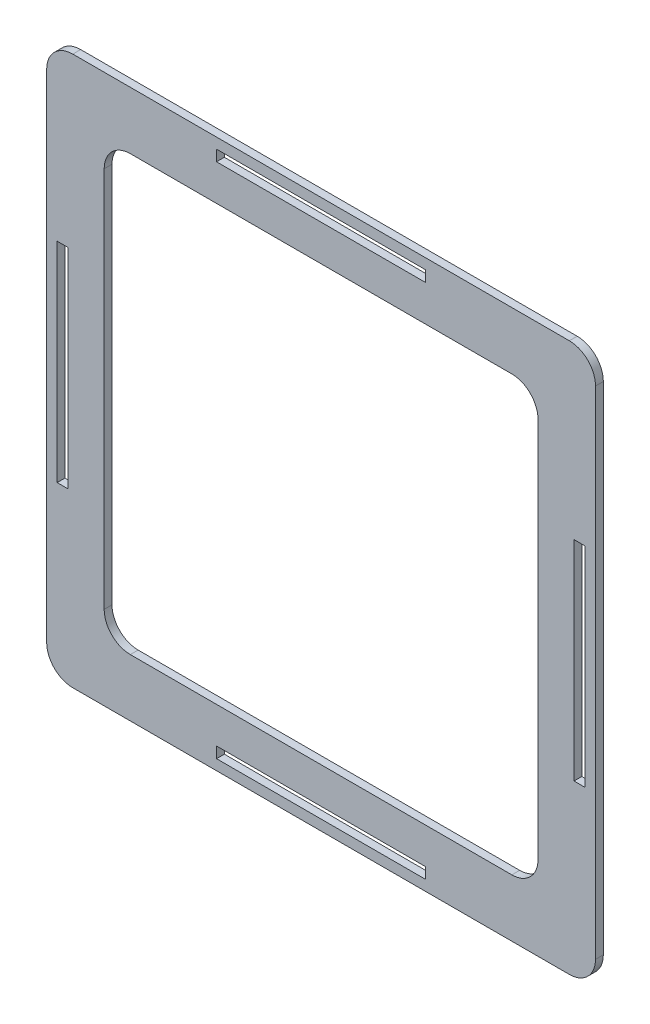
ISO-10303-21;
HEADER;
FILE_DESCRIPTION(('STEP AP214'),'2;1');
FILE_NAME('part.step','',(''),(''),'','','');
FILE_SCHEMA(('AUTOMOTIVE_DESIGN { 1 0 10303 214 1 1 1 1 }'));
ENDSEC;
DATA;
#1=APPLICATION_CONTEXT('core data for automotive mechanical design processes');
#2=APPLICATION_PROTOCOL_DEFINITION('international standard','automotive_design',2000,#1);
#3=PRODUCT_CONTEXT('',#1,'mechanical');
#4=PRODUCT('Part','Part','',(#3));
#5=PRODUCT_RELATED_PRODUCT_CATEGORY('part','',(#4));
#6=PRODUCT_DEFINITION_FORMATION('','',#4);
#7=PRODUCT_DEFINITION_CONTEXT('part definition',#1,'design');
#8=PRODUCT_DEFINITION('design','',#6,#7);
#9=PRODUCT_DEFINITION_SHAPE('','',#8);
#10=(LENGTH_UNIT() NAMED_UNIT(*) SI_UNIT(.MILLI.,.METRE.));
#11=(NAMED_UNIT(*) PLANE_ANGLE_UNIT() SI_UNIT($,.RADIAN.));
#12=(NAMED_UNIT(*) SI_UNIT($,.STERADIAN.) SOLID_ANGLE_UNIT());
#13=UNCERTAINTY_MEASURE_WITH_UNIT(LENGTH_MEASURE(1.E-05),#10,'distance_accuracy_value','');
#14=(GEOMETRIC_REPRESENTATION_CONTEXT(3) GLOBAL_UNCERTAINTY_ASSIGNED_CONTEXT((#13)) GLOBAL_UNIT_ASSIGNED_CONTEXT((#10,
#11,#12)) REPRESENTATION_CONTEXT('',''));
#15=CARTESIAN_POINT('',(0.,0.,0.));
#16=DIRECTION('',(0.,0.,1.));
#17=DIRECTION('',(1.,0.,0.));
#18=AXIS2_PLACEMENT_3D('',#15,#16,#17);
#19=CARTESIAN_POINT('',(47.5,-47.5,1.5));
#20=DIRECTION('',(0.,0.,1.));
#21=DIRECTION('',(1.,0.,0.));
#22=AXIS2_PLACEMENT_3D('',#19,#20,#21);
#23=PLANE('',#22);
#24=CARTESIAN_POINT('',(47.5,-47.5,1.5));
#25=DIRECTION('',(0.,0.,1.));
#26=DIRECTION('',(1.,0.,0.));
#27=AXIS2_PLACEMENT_3D('',#24,#25,#26);
#28=CIRCLE('',#27,5.);
#29=CARTESIAN_POINT('',(47.5,-52.5,1.5));
#30=VERTEX_POINT('',#29);
#31=CARTESIAN_POINT('',(52.5,-47.5,1.5));
#32=VERTEX_POINT('',#31);
#33=EDGE_CURVE('E510',#30,#32,#28,.T.);
#34=ORIENTED_EDGE('',*,*,#33,.T.);
#35=DIRECTION('',(0.,1.,0.));
#36=VECTOR('',#35,1.);
#37=CARTESIAN_POINT('',(52.5,47.4999999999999,1.5));
#38=LINE('',#37,#36);
#39=CARTESIAN_POINT('',(52.5,47.4999999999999,1.5));
#40=VERTEX_POINT('',#39);
#41=EDGE_CURVE('E514',#32,#40,#38,.T.);
#42=ORIENTED_EDGE('',*,*,#41,.T.);
#43=CARTESIAN_POINT('',(47.5,47.5,1.5));
#44=DIRECTION('',(0.,0.,1.));
#45=DIRECTION('',(-1.,0.,0.));
#46=AXIS2_PLACEMENT_3D('',#43,#44,#45);
#47=CIRCLE('',#46,5.);
#48=CARTESIAN_POINT('',(47.5,52.5,1.5));
#49=VERTEX_POINT('',#48);
#50=EDGE_CURVE('E518',#40,#49,#47,.T.);
#51=ORIENTED_EDGE('',*,*,#50,.T.);
#52=DIRECTION('',(-1.,0.,0.));
#53=VECTOR('',#52,1.);
#54=CARTESIAN_POINT('',(-47.4999999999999,52.5,1.5));
#55=LINE('',#54,#53);
#56=CARTESIAN_POINT('',(-47.4999999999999,52.5,1.5));
#57=VERTEX_POINT('',#56);
#58=EDGE_CURVE('E521',#49,#57,#55,.T.);
#59=ORIENTED_EDGE('',*,*,#58,.T.);
#60=CARTESIAN_POINT('',(-47.4999999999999,47.5,1.5));
#61=DIRECTION('',(0.,0.,1.));
#62=DIRECTION('',(1.,0.,0.));
#63=AXIS2_PLACEMENT_3D('',#60,#61,#62);
#64=CIRCLE('',#63,5.);
#65=CARTESIAN_POINT('',(-52.4999999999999,47.4999999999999,1.5));
#66=VERTEX_POINT('',#65);
#67=EDGE_CURVE('E524',#57,#66,#64,.T.);
#68=ORIENTED_EDGE('',*,*,#67,.T.);
#69=DIRECTION('',(0.,-1.,0.));
#70=VECTOR('',#69,1.);
#71=CARTESIAN_POINT('',(-52.4999999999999,47.4999999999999,1.5));
#72=LINE('',#71,#70);
#73=CARTESIAN_POINT('',(-52.4999999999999,-47.5,1.5));
#74=VERTEX_POINT('',#73);
#75=EDGE_CURVE('E527',#66,#74,#72,.T.);
#76=ORIENTED_EDGE('',*,*,#75,.T.);
#77=CARTESIAN_POINT('',(-47.4999999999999,-47.5,1.5));
#78=DIRECTION('',(0.,0.,1.));
#79=DIRECTION('',(1.,0.,0.));
#80=AXIS2_PLACEMENT_3D('',#77,#78,#79);
#81=CIRCLE('',#80,5.);
#82=CARTESIAN_POINT('',(-47.4999999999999,-52.5,1.5));
#83=VERTEX_POINT('',#82);
#84=EDGE_CURVE('E530',#74,#83,#81,.T.);
#85=ORIENTED_EDGE('',*,*,#84,.T.);
#86=DIRECTION('',(1.,0.,0.));
#87=VECTOR('',#86,1.);
#88=CARTESIAN_POINT('',(-47.4999999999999,-52.5,1.5));
#89=LINE('',#88,#87);
#90=EDGE_CURVE('E533',#83,#30,#89,.T.);
#91=ORIENTED_EDGE('',*,*,#90,.T.);
#92=EDGE_LOOP('',(#34,#42,#51,#59,#68,#76,#85,#91));
#93=FACE_BOUND('',#92,.T.);
#94=DIRECTION('',(1.,0.,0.));
#95=VECTOR('',#94,1.);
#96=CARTESIAN_POINT('',(-50.4999999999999,-20.,1.5));
#97=LINE('',#96,#95);
#98=CARTESIAN_POINT('',(-50.4999999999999,-20.,1.5));
#99=VERTEX_POINT('',#98);
#100=CARTESIAN_POINT('',(-48.3999999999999,-20.,1.5));
#101=VERTEX_POINT('',#100);
#102=EDGE_CURVE('E470',#99,#101,#97,.T.);
#103=ORIENTED_EDGE('',*,*,#102,.F.);
#104=DIRECTION('',(0.,-1.,0.));
#105=VECTOR('',#104,1.);
#106=CARTESIAN_POINT('',(-50.4999999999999,20.,1.5));
#107=LINE('',#106,#105);
#108=CARTESIAN_POINT('',(-50.4999999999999,20.,1.5));
#109=VERTEX_POINT('',#108);
#110=EDGE_CURVE('E467',#109,#99,#107,.T.);
#111=ORIENTED_EDGE('',*,*,#110,.F.);
#112=DIRECTION('',(-1.,0.,0.));
#113=VECTOR('',#112,1.);
#114=CARTESIAN_POINT('',(-50.4999999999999,20.,1.5));
#115=LINE('',#114,#113);
#116=CARTESIAN_POINT('',(-48.3999999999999,20.,1.5));
#117=VERTEX_POINT('',#116);
#118=EDGE_CURVE('E478',#117,#109,#115,.T.);
#119=ORIENTED_EDGE('',*,*,#118,.F.);
#120=DIRECTION('',(0.,1.,0.));
#121=VECTOR('',#120,1.);
#122=CARTESIAN_POINT('',(-48.3999999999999,20.,1.5));
#123=LINE('',#122,#121);
#124=EDGE_CURVE('E474',#101,#117,#123,.T.);
#125=ORIENTED_EDGE('',*,*,#124,.F.);
#126=EDGE_LOOP('',(#103,#111,#119,#125));
#127=FACE_BOUND('',#126,.T.);
#128=DIRECTION('',(0.,-1.,0.));
#129=VECTOR('',#128,1.);
#130=CARTESIAN_POINT('',(-20.0000000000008,50.5000000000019,1.5));
#131=LINE('',#130,#129);
#132=CARTESIAN_POINT('',(-20.0000000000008,50.5000000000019,1.5));
#133=VERTEX_POINT('',#132);
#134=CARTESIAN_POINT('',(-20.0000000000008,48.4000000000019,1.5));
#135=VERTEX_POINT('',#134);
#136=EDGE_CURVE('E427',#133,#135,#131,.T.);
#137=ORIENTED_EDGE('',*,*,#136,.F.);
#138=DIRECTION('',(-1.,0.,0.));
#139=VECTOR('',#138,1.);
#140=CARTESIAN_POINT('',(19.9999999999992,50.5000000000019,1.5));
#141=LINE('',#140,#139);
#142=CARTESIAN_POINT('',(19.9999999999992,50.5000000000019,1.5));
#143=VERTEX_POINT('',#142);
#144=EDGE_CURVE('E424',#143,#133,#141,.T.);
#145=ORIENTED_EDGE('',*,*,#144,.F.);
#146=DIRECTION('',(0.,1.,0.));
#147=VECTOR('',#146,1.);
#148=CARTESIAN_POINT('',(19.9999999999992,50.5000000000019,1.5));
#149=LINE('',#148,#147);
#150=CARTESIAN_POINT('',(19.9999999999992,48.4000000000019,1.5));
#151=VERTEX_POINT('',#150);
#152=EDGE_CURVE('E435',#151,#143,#149,.T.);
#153=ORIENTED_EDGE('',*,*,#152,.F.);
#154=DIRECTION('',(1.,0.,0.));
#155=VECTOR('',#154,1.);
#156=CARTESIAN_POINT('',(19.9999999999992,48.4000000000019,1.5));
#157=LINE('',#156,#155);
#158=EDGE_CURVE('E431',#135,#151,#157,.T.);
#159=ORIENTED_EDGE('',*,*,#158,.F.);
#160=EDGE_LOOP('',(#137,#145,#153,#159));
#161=FACE_BOUND('',#160,.T.);
#162=DIRECTION('',(-1.,0.,0.));
#163=VECTOR('',#162,1.);
#164=CARTESIAN_POINT('',(50.5000000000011,20.0000000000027,1.5));
#165=LINE('',#164,#163);
#166=CARTESIAN_POINT('',(50.5000000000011,20.0000000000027,1.5));
#167=VERTEX_POINT('',#166);
#168=CARTESIAN_POINT('',(48.4000000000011,20.0000000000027,1.5));
#169=VERTEX_POINT('',#168);
#170=EDGE_CURVE('E384',#167,#169,#165,.T.);
#171=ORIENTED_EDGE('',*,*,#170,.F.);
#172=DIRECTION('',(0.,1.,0.));
#173=VECTOR('',#172,1.);
#174=CARTESIAN_POINT('',(50.5000000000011,-19.9999999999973,1.5));
#175=LINE('',#174,#173);
#176=CARTESIAN_POINT('',(50.5000000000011,-19.9999999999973,1.5));
#177=VERTEX_POINT('',#176);
#178=EDGE_CURVE('E381',#177,#167,#175,.T.);
#179=ORIENTED_EDGE('',*,*,#178,.F.);
#180=DIRECTION('',(1.,0.,0.));
#181=VECTOR('',#180,1.);
#182=CARTESIAN_POINT('',(50.5000000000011,-19.9999999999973,1.5));
#183=LINE('',#182,#181);
#184=CARTESIAN_POINT('',(48.4000000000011,-19.9999999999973,1.5));
#185=VERTEX_POINT('',#184);
#186=EDGE_CURVE('E392',#185,#177,#183,.T.);
#187=ORIENTED_EDGE('',*,*,#186,.F.);
#188=DIRECTION('',(0.,-1.,0.));
#189=VECTOR('',#188,1.);
#190=CARTESIAN_POINT('',(48.4000000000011,-19.9999999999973,1.5));
#191=LINE('',#190,#189);
#192=EDGE_CURVE('E388',#169,#185,#191,.T.);
#193=ORIENTED_EDGE('',*,*,#192,.F.);
#194=EDGE_LOOP('',(#171,#179,#187,#193));
#195=FACE_BOUND('',#194,.T.);
#196=DIRECTION('',(0.,1.,0.));
#197=VECTOR('',#196,1.);
#198=CARTESIAN_POINT('',(20.000000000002,-50.4999999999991,1.5));
#199=LINE('',#198,#197);
#200=CARTESIAN_POINT('',(20.000000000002,-50.4999999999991,1.5));
#201=VERTEX_POINT('',#200);
#202=CARTESIAN_POINT('',(20.000000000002,-48.3999999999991,1.5));
#203=VERTEX_POINT('',#202);
#204=EDGE_CURVE('E341',#201,#203,#199,.T.);
#205=ORIENTED_EDGE('',*,*,#204,.F.);
#206=DIRECTION('',(1.,0.,0.));
#207=VECTOR('',#206,1.);
#208=CARTESIAN_POINT('',(-19.999999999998,-50.4999999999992,1.5));
#209=LINE('',#208,#207);
#210=CARTESIAN_POINT('',(-19.999999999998,-50.4999999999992,1.5));
#211=VERTEX_POINT('',#210);
#212=EDGE_CURVE('E338',#211,#201,#209,.T.);
#213=ORIENTED_EDGE('',*,*,#212,.F.);
#214=DIRECTION('',(0.,-1.,0.));
#215=VECTOR('',#214,1.);
#216=CARTESIAN_POINT('',(-19.999999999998,-50.4999999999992,1.5));
#217=LINE('',#216,#215);
#218=CARTESIAN_POINT('',(-19.999999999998,-48.3999999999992,1.5));
#219=VERTEX_POINT('',#218);
#220=EDGE_CURVE('E349',#219,#211,#217,.T.);
#221=ORIENTED_EDGE('',*,*,#220,.F.);
#222=DIRECTION('',(-1.,0.,0.));
#223=VECTOR('',#222,1.);
#224=CARTESIAN_POINT('',(-19.999999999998,-48.3999999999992,1.5));
#225=LINE('',#224,#223);
#226=EDGE_CURVE('E345',#203,#219,#225,.T.);
#227=ORIENTED_EDGE('',*,*,#226,.F.);
#228=EDGE_LOOP('',(#205,#213,#221,#227));
#229=FACE_BOUND('',#228,.T.);
#230=DIRECTION('',(1.,0.,0.));
#231=VECTOR('',#230,1.);
#232=CARTESIAN_POINT('',(-36.5,-41.5,1.5));
#233=LINE('',#232,#231);
#234=CARTESIAN_POINT('',(-36.5,-41.5,1.5));
#235=VERTEX_POINT('',#234);
#236=CARTESIAN_POINT('',(36.5,-41.5,1.5));
#237=VERTEX_POINT('',#236);
#238=EDGE_CURVE('E258',#235,#237,#233,.T.);
#239=ORIENTED_EDGE('',*,*,#238,.F.);
#240=CARTESIAN_POINT('',(-36.5,-36.5,1.5));
#241=DIRECTION('',(0.,0.,1.));
#242=DIRECTION('',(1.,0.,0.));
#243=AXIS2_PLACEMENT_3D('',#240,#241,#242);
#244=CIRCLE('',#243,4.99999999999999);
#245=CARTESIAN_POINT('',(-41.5,-36.5,1.5));
#246=VERTEX_POINT('',#245);
#247=EDGE_CURVE('E249',#246,#235,#244,.T.);
#248=ORIENTED_EDGE('',*,*,#247,.F.);
#249=DIRECTION('',(0.,-1.,0.));
#250=VECTOR('',#249,1.);
#251=CARTESIAN_POINT('',(-41.5,36.5,1.5));
#252=LINE('',#251,#250);
#253=CARTESIAN_POINT('',(-41.5,36.5,1.5));
#254=VERTEX_POINT('',#253);
#255=EDGE_CURVE('E290',#254,#246,#252,.T.);
#256=ORIENTED_EDGE('',*,*,#255,.F.);
#257=CARTESIAN_POINT('',(-36.5,36.5,1.5));
#258=DIRECTION('',(0.,0.,1.));
#259=DIRECTION('',(-1.,0.,0.));
#260=AXIS2_PLACEMENT_3D('',#257,#258,#259);
#261=CIRCLE('',#260,4.99999999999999);
#262=CARTESIAN_POINT('',(-36.5,41.5,1.5));
#263=VERTEX_POINT('',#262);
#264=EDGE_CURVE('E287',#263,#254,#261,.T.);
#265=ORIENTED_EDGE('',*,*,#264,.F.);
#266=DIRECTION('',(-1.,0.,0.));
#267=VECTOR('',#266,1.);
#268=CARTESIAN_POINT('',(-36.5,41.4999999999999,1.5));
#269=LINE('',#268,#267);
#270=CARTESIAN_POINT('',(36.5,41.5,1.5));
#271=VERTEX_POINT('',#270);
#272=EDGE_CURVE('E284',#271,#263,#269,.T.);
#273=ORIENTED_EDGE('',*,*,#272,.F.);
#274=CARTESIAN_POINT('',(36.5,36.5,1.5));
#275=DIRECTION('',(0.,0.,1.));
#276=DIRECTION('',(-1.,0.,0.));
#277=AXIS2_PLACEMENT_3D('',#274,#275,#276);
#278=CIRCLE('',#277,4.99999999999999);
#279=CARTESIAN_POINT('',(41.5,36.5,1.5));
#280=VERTEX_POINT('',#279);
#281=EDGE_CURVE('E281',#280,#271,#278,.T.);
#282=ORIENTED_EDGE('',*,*,#281,.F.);
#283=DIRECTION('',(0.,1.,0.));
#284=VECTOR('',#283,1.);
#285=CARTESIAN_POINT('',(41.5,36.5,1.5));
#286=LINE('',#285,#284);
#287=CARTESIAN_POINT('',(41.5,-36.5,1.5));
#288=VERTEX_POINT('',#287);
#289=EDGE_CURVE('E276',#288,#280,#286,.T.);
#290=ORIENTED_EDGE('',*,*,#289,.F.);
#291=CARTESIAN_POINT('',(36.5,-36.5,1.5));
#292=DIRECTION('',(0.,0.,1.));
#293=DIRECTION('',(1.,0.,0.));
#294=AXIS2_PLACEMENT_3D('',#291,#292,#293);
#295=CIRCLE('',#294,5.);
#296=EDGE_CURVE('E272',#237,#288,#295,.T.);
#297=ORIENTED_EDGE('',*,*,#296,.F.);
#298=EDGE_LOOP('',(#239,#248,#256,#265,#273,#282,#290,#297));
#299=FACE_BOUND('',#298,.T.);
#300=ADVANCED_FACE('F39',(#93,#127,#161,#195,#229,#299),#23,.T.);
#301=CARTESIAN_POINT('',(47.5,-47.5,0.));
#302=DIRECTION('',(0.,0.,1.));
#303=DIRECTION('',(1.,0.,0.));
#304=AXIS2_PLACEMENT_3D('',#301,#302,#303);
#305=PLANE('',#304);
#306=DIRECTION('',(1.,0.,0.));
#307=VECTOR('',#306,1.);
#308=CARTESIAN_POINT('',(-19.999999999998,-50.4999999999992,0.));
#309=LINE('',#308,#307);
#310=CARTESIAN_POINT('',(-19.999999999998,-50.4999999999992,0.));
#311=VERTEX_POINT('',#310);
#312=CARTESIAN_POINT('',(20.000000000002,-50.4999999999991,0.));
#313=VERTEX_POINT('',#312);
#314=EDGE_CURVE('E267',#311,#313,#309,.T.);
#315=ORIENTED_EDGE('',*,*,#314,.T.);
#316=DIRECTION('',(0.,1.,0.));
#317=VECTOR('',#316,1.);
#318=CARTESIAN_POINT('',(20.000000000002,-50.4999999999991,0.));
#319=LINE('',#318,#317);
#320=CARTESIAN_POINT('',(20.000000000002,-48.3999999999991,0.));
#321=VERTEX_POINT('',#320);
#322=EDGE_CURVE('E356',#313,#321,#319,.T.);
#323=ORIENTED_EDGE('',*,*,#322,.T.);
#324=DIRECTION('',(-1.,0.,0.));
#325=VECTOR('',#324,1.);
#326=CARTESIAN_POINT('',(-19.999999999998,-48.3999999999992,0.));
#327=LINE('',#326,#325);
#328=CARTESIAN_POINT('',(-19.999999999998,-48.3999999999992,0.));
#329=VERTEX_POINT('',#328);
#330=EDGE_CURVE('E360',#321,#329,#327,.T.);
#331=ORIENTED_EDGE('',*,*,#330,.T.);
#332=DIRECTION('',(0.,-1.,0.));
#333=VECTOR('',#332,1.);
#334=CARTESIAN_POINT('',(-19.999999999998,-50.4999999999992,0.));
#335=LINE('',#334,#333);
#336=EDGE_CURVE('E342',#329,#311,#335,.T.);
#337=ORIENTED_EDGE('',*,*,#336,.T.);
#338=EDGE_LOOP('',(#315,#323,#331,#337));
#339=FACE_BOUND('',#338,.T.);
#340=DIRECTION('',(-1.,0.,0.));
#341=VECTOR('',#340,1.);
#342=CARTESIAN_POINT('',(19.9999999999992,50.5000000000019,0.));
#343=LINE('',#342,#341);
#344=CARTESIAN_POINT('',(19.9999999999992,50.5000000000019,0.));
#345=VERTEX_POINT('',#344);
#346=CARTESIAN_POINT('',(-20.0000000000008,50.5000000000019,0.));
#347=VERTEX_POINT('',#346);
#348=EDGE_CURVE('E423',#345,#347,#343,.T.);
#349=ORIENTED_EDGE('',*,*,#348,.T.);
#350=DIRECTION('',(0.,-1.,0.));
#351=VECTOR('',#350,1.);
#352=CARTESIAN_POINT('',(-20.0000000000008,50.5000000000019,0.));
#353=LINE('',#352,#351);
#354=CARTESIAN_POINT('',(-20.0000000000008,48.4000000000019,0.));
#355=VERTEX_POINT('',#354);
#356=EDGE_CURVE('E442',#347,#355,#353,.T.);
#357=ORIENTED_EDGE('',*,*,#356,.T.);
#358=DIRECTION('',(1.,0.,0.));
#359=VECTOR('',#358,1.);
#360=CARTESIAN_POINT('',(19.9999999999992,48.4000000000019,0.));
#361=LINE('',#360,#359);
#362=CARTESIAN_POINT('',(19.9999999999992,48.4000000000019,0.));
#363=VERTEX_POINT('',#362);
#364=EDGE_CURVE('E446',#355,#363,#361,.T.);
#365=ORIENTED_EDGE('',*,*,#364,.T.);
#366=DIRECTION('',(0.,1.,0.));
#367=VECTOR('',#366,1.);
#368=CARTESIAN_POINT('',(19.9999999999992,50.5000000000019,0.));
#369=LINE('',#368,#367);
#370=EDGE_CURVE('E428',#363,#345,#369,.T.);
#371=ORIENTED_EDGE('',*,*,#370,.T.);
#372=EDGE_LOOP('',(#349,#357,#365,#371));
#373=FACE_BOUND('',#372,.T.);
#374=CARTESIAN_POINT('',(47.5,-47.5,0.));
#375=DIRECTION('',(0.,0.,1.));
#376=DIRECTION('',(1.,0.,0.));
#377=AXIS2_PLACEMENT_3D('',#374,#375,#376);
#378=CIRCLE('',#377,5.);
#379=CARTESIAN_POINT('',(47.5,-52.5,0.));
#380=VERTEX_POINT('',#379);
#381=CARTESIAN_POINT('',(52.5,-47.5,0.));
#382=VERTEX_POINT('',#381);
#383=EDGE_CURVE('E509',#380,#382,#378,.T.);
#384=ORIENTED_EDGE('',*,*,#383,.F.);
#385=DIRECTION('',(1.,0.,0.));
#386=VECTOR('',#385,1.);
#387=CARTESIAN_POINT('',(-47.4999999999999,-52.5,0.));
#388=LINE('',#387,#386);
#389=CARTESIAN_POINT('',(-47.4999999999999,-52.5,0.));
#390=VERTEX_POINT('',#389);
#391=EDGE_CURVE('E515',#390,#380,#388,.T.);
#392=ORIENTED_EDGE('',*,*,#391,.F.);
#393=CARTESIAN_POINT('',(-47.4999999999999,-47.5,0.));
#394=DIRECTION('',(0.,0.,1.));
#395=DIRECTION('',(1.,0.,0.));
#396=AXIS2_PLACEMENT_3D('',#393,#394,#395);
#397=CIRCLE('',#396,5.);
#398=CARTESIAN_POINT('',(-52.4999999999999,-47.5,0.));
#399=VERTEX_POINT('',#398);
#400=EDGE_CURVE('E555',#399,#390,#397,.T.);
#401=ORIENTED_EDGE('',*,*,#400,.F.);
#402=DIRECTION('',(0.,-1.,0.));
#403=VECTOR('',#402,1.);
#404=CARTESIAN_POINT('',(-52.4999999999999,47.4999999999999,0.));
#405=LINE('',#404,#403);
#406=CARTESIAN_POINT('',(-52.4999999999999,47.4999999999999,0.));
#407=VERTEX_POINT('',#406);
#408=EDGE_CURVE('E552',#407,#399,#405,.T.);
#409=ORIENTED_EDGE('',*,*,#408,.F.);
#410=CARTESIAN_POINT('',(-47.4999999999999,47.5,0.));
#411=DIRECTION('',(0.,0.,1.));
#412=DIRECTION('',(1.,0.,0.));
#413=AXIS2_PLACEMENT_3D('',#410,#411,#412);
#414=CIRCLE('',#413,5.);
#415=CARTESIAN_POINT('',(-47.4999999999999,52.5,0.));
#416=VERTEX_POINT('',#415);
#417=EDGE_CURVE('E549',#416,#407,#414,.T.);
#418=ORIENTED_EDGE('',*,*,#417,.F.);
#419=DIRECTION('',(-1.,0.,0.));
#420=VECTOR('',#419,1.);
#421=CARTESIAN_POINT('',(-47.4999999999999,52.5,0.));
#422=LINE('',#421,#420);
#423=CARTESIAN_POINT('',(47.5,52.5,0.));
#424=VERTEX_POINT('',#423);
#425=EDGE_CURVE('E546',#424,#416,#422,.T.);
#426=ORIENTED_EDGE('',*,*,#425,.F.);
#427=CARTESIAN_POINT('',(47.5,47.5,0.));
#428=DIRECTION('',(0.,0.,1.));
#429=DIRECTION('',(-1.,0.,0.));
#430=AXIS2_PLACEMENT_3D('',#427,#428,#429);
#431=CIRCLE('',#430,5.);
#432=CARTESIAN_POINT('',(52.5,47.4999999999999,0.));
#433=VERTEX_POINT('',#432);
#434=EDGE_CURVE('E543',#433,#424,#431,.T.);
#435=ORIENTED_EDGE('',*,*,#434,.F.);
#436=DIRECTION('',(0.,1.,0.));
#437=VECTOR('',#436,1.);
#438=CARTESIAN_POINT('',(52.5,47.4999999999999,0.));
#439=LINE('',#438,#437);
#440=EDGE_CURVE('E540',#382,#433,#439,.T.);
#441=ORIENTED_EDGE('',*,*,#440,.F.);
#442=EDGE_LOOP('',(#384,#392,#401,#409,#418,#426,#435,#441));
#443=FACE_BOUND('',#442,.T.);
#444=DIRECTION('',(0.,-1.,0.));
#445=VECTOR('',#444,1.);
#446=CARTESIAN_POINT('',(-50.4999999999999,20.,0.));
#447=LINE('',#446,#445);
#448=CARTESIAN_POINT('',(-50.4999999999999,20.,0.));
#449=VERTEX_POINT('',#448);
#450=CARTESIAN_POINT('',(-50.4999999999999,-20.,0.));
#451=VERTEX_POINT('',#450);
#452=EDGE_CURVE('E466',#449,#451,#447,.T.);
#453=ORIENTED_EDGE('',*,*,#452,.T.);
#454=DIRECTION('',(1.,0.,0.));
#455=VECTOR('',#454,1.);
#456=CARTESIAN_POINT('',(-50.4999999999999,-20.,0.));
#457=LINE('',#456,#455);
#458=CARTESIAN_POINT('',(-48.3999999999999,-20.,0.));
#459=VERTEX_POINT('',#458);
#460=EDGE_CURVE('E485',#451,#459,#457,.T.);
#461=ORIENTED_EDGE('',*,*,#460,.T.);
#462=DIRECTION('',(0.,1.,0.));
#463=VECTOR('',#462,1.);
#464=CARTESIAN_POINT('',(-48.3999999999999,20.,0.));
#465=LINE('',#464,#463);
#466=CARTESIAN_POINT('',(-48.3999999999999,20.,0.));
#467=VERTEX_POINT('',#466);
#468=EDGE_CURVE('E489',#459,#467,#465,.T.);
#469=ORIENTED_EDGE('',*,*,#468,.T.);
#470=DIRECTION('',(-1.,0.,0.));
#471=VECTOR('',#470,1.);
#472=CARTESIAN_POINT('',(-50.4999999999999,20.,0.));
#473=LINE('',#472,#471);
#474=EDGE_CURVE('E471',#467,#449,#473,.T.);
#475=ORIENTED_EDGE('',*,*,#474,.T.);
#476=EDGE_LOOP('',(#453,#461,#469,#475));
#477=FACE_BOUND('',#476,.T.);
#478=DIRECTION('',(0.,1.,0.));
#479=VECTOR('',#478,1.);
#480=CARTESIAN_POINT('',(50.5000000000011,-19.9999999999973,0.));
#481=LINE('',#480,#479);
#482=CARTESIAN_POINT('',(50.5000000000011,-19.9999999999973,0.));
#483=VERTEX_POINT('',#482);
#484=CARTESIAN_POINT('',(50.5000000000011,20.0000000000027,0.));
#485=VERTEX_POINT('',#484);
#486=EDGE_CURVE('E380',#483,#485,#481,.T.);
#487=ORIENTED_EDGE('',*,*,#486,.T.);
#488=DIRECTION('',(-1.,0.,0.));
#489=VECTOR('',#488,1.);
#490=CARTESIAN_POINT('',(50.5000000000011,20.0000000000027,0.));
#491=LINE('',#490,#489);
#492=CARTESIAN_POINT('',(48.4000000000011,20.0000000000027,0.));
#493=VERTEX_POINT('',#492);
#494=EDGE_CURVE('E399',#485,#493,#491,.T.);
#495=ORIENTED_EDGE('',*,*,#494,.T.);
#496=DIRECTION('',(0.,-1.,0.));
#497=VECTOR('',#496,1.);
#498=CARTESIAN_POINT('',(48.4000000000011,-19.9999999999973,0.));
#499=LINE('',#498,#497);
#500=CARTESIAN_POINT('',(48.4000000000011,-19.9999999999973,0.));
#501=VERTEX_POINT('',#500);
#502=EDGE_CURVE('E403',#493,#501,#499,.T.);
#503=ORIENTED_EDGE('',*,*,#502,.T.);
#504=DIRECTION('',(1.,0.,0.));
#505=VECTOR('',#504,1.);
#506=CARTESIAN_POINT('',(50.5000000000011,-19.9999999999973,0.));
#507=LINE('',#506,#505);
#508=EDGE_CURVE('E385',#501,#483,#507,.T.);
#509=ORIENTED_EDGE('',*,*,#508,.T.);
#510=EDGE_LOOP('',(#487,#495,#503,#509));
#511=FACE_BOUND('',#510,.T.);
#512=CARTESIAN_POINT('',(-36.5,-36.5,0.));
#513=DIRECTION('',(0.,0.,1.));
#514=DIRECTION('',(1.,0.,0.));
#515=AXIS2_PLACEMENT_3D('',#512,#513,#514);
#516=CIRCLE('',#515,4.99999999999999);
#517=CARTESIAN_POINT('',(-41.5,-36.5,0.));
#518=VERTEX_POINT('',#517);
#519=CARTESIAN_POINT('',(-36.5,-41.5,0.));
#520=VERTEX_POINT('',#519);
#521=EDGE_CURVE('E63',#518,#520,#516,.T.);
#522=ORIENTED_EDGE('',*,*,#521,.T.);
#523=DIRECTION('',(1.,0.,0.));
#524=VECTOR('',#523,1.);
#525=CARTESIAN_POINT('',(-36.5,-41.5,0.));
#526=LINE('',#525,#524);
#527=CARTESIAN_POINT('',(36.5,-41.5,0.));
#528=VERTEX_POINT('',#527);
#529=EDGE_CURVE('E265',#520,#528,#526,.T.);
#530=ORIENTED_EDGE('',*,*,#529,.T.);
#531=CARTESIAN_POINT('',(36.5,-36.5,0.));
#532=DIRECTION('',(0.,0.,1.));
#533=DIRECTION('',(1.,0.,0.));
#534=AXIS2_PLACEMENT_3D('',#531,#532,#533);
#535=CIRCLE('',#534,5.);
#536=CARTESIAN_POINT('',(41.5,-36.5,0.));
#537=VERTEX_POINT('',#536);
#538=EDGE_CURVE('E297',#528,#537,#535,.T.);
#539=ORIENTED_EDGE('',*,*,#538,.T.);
#540=DIRECTION('',(0.,1.,0.));
#541=VECTOR('',#540,1.);
#542=CARTESIAN_POINT('',(41.5,36.5,0.));
#543=LINE('',#542,#541);
#544=CARTESIAN_POINT('',(41.5,36.5,0.));
#545=VERTEX_POINT('',#544);
#546=EDGE_CURVE('E301',#537,#545,#543,.T.);
#547=ORIENTED_EDGE('',*,*,#546,.T.);
#548=CARTESIAN_POINT('',(36.5,36.5,0.));
#549=DIRECTION('',(0.,0.,1.));
#550=DIRECTION('',(-1.,0.,0.));
#551=AXIS2_PLACEMENT_3D('',#548,#549,#550);
#552=CIRCLE('',#551,4.99999999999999);
#553=CARTESIAN_POINT('',(36.5,41.5,0.));
#554=VERTEX_POINT('',#553);
#555=EDGE_CURVE('E305',#545,#554,#552,.T.);
#556=ORIENTED_EDGE('',*,*,#555,.T.);
#557=DIRECTION('',(-1.,0.,0.));
#558=VECTOR('',#557,1.);
#559=CARTESIAN_POINT('',(-36.5,41.4999999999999,0.));
#560=LINE('',#559,#558);
#561=CARTESIAN_POINT('',(-36.5,41.5,0.));
#562=VERTEX_POINT('',#561);
#563=EDGE_CURVE('E309',#554,#562,#560,.T.);
#564=ORIENTED_EDGE('',*,*,#563,.T.);
#565=CARTESIAN_POINT('',(-36.5,36.5,0.));
#566=DIRECTION('',(0.,0.,1.));
#567=DIRECTION('',(-1.,0.,0.));
#568=AXIS2_PLACEMENT_3D('',#565,#566,#567);
#569=CIRCLE('',#568,4.99999999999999);
#570=CARTESIAN_POINT('',(-41.5,36.5,0.));
#571=VERTEX_POINT('',#570);
#572=EDGE_CURVE('E313',#562,#571,#569,.T.);
#573=ORIENTED_EDGE('',*,*,#572,.T.);
#574=DIRECTION('',(0.,-1.,0.));
#575=VECTOR('',#574,1.);
#576=CARTESIAN_POINT('',(-41.5,36.5,0.));
#577=LINE('',#576,#575);
#578=EDGE_CURVE('E259',#571,#518,#577,.T.);
#579=ORIENTED_EDGE('',*,*,#578,.T.);
#580=EDGE_LOOP('',(#522,#530,#539,#547,#556,#564,#573,#579));
#581=FACE_BOUND('',#580,.T.);
#582=ADVANCED_FACE('F594',(#339,#373,#443,#477,#511,#581),#305,.F.);
#583=CARTESIAN_POINT('',(47.5,-47.5,1.5));
#584=DIRECTION('',(0.,0.,-1.));
#585=DIRECTION('',(-1.,0.,0.));
#586=AXIS2_PLACEMENT_3D('',#583,#584,#585);
#587=CYLINDRICAL_SURFACE('',#586,5.);
#588=ORIENTED_EDGE('',*,*,#383,.T.);
#589=DIRECTION('',(0.,0.,-1.));
#590=VECTOR('',#589,1.);
#591=CARTESIAN_POINT('',(52.5,-47.5,1.5));
#592=LINE('',#591,#590);
#593=EDGE_CURVE('E11',#32,#382,#592,.T.);
#594=ORIENTED_EDGE('',*,*,#593,.F.);
#595=ORIENTED_EDGE('',*,*,#33,.F.);
#596=DIRECTION('',(0.,0.,-1.));
#597=VECTOR('',#596,1.);
#598=CARTESIAN_POINT('',(47.5,-52.5,1.5));
#599=LINE('',#598,#597);
#600=EDGE_CURVE('E536',#30,#380,#599,.T.);
#601=ORIENTED_EDGE('',*,*,#600,.T.);
#602=EDGE_LOOP('',(#588,#594,#595,#601));
#603=FACE_BOUND('',#602,.T.);
#604=ADVANCED_FACE('F41',(#603),#587,.T.);
#605=CARTESIAN_POINT('',(52.5,47.4999999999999,1.5));
#606=DIRECTION('',(-1.,0.,0.));
#607=DIRECTION('',(0.,-1.,0.));
#608=AXIS2_PLACEMENT_3D('',#605,#606,#607);
#609=PLANE('',#608);
#610=ORIENTED_EDGE('',*,*,#440,.T.);
#611=DIRECTION('',(0.,0.,-1.));
#612=VECTOR('',#611,1.);
#613=CARTESIAN_POINT('',(52.5,47.4999999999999,1.5));
#614=LINE('',#613,#612);
#615=EDGE_CURVE('E48',#40,#433,#614,.T.);
#616=ORIENTED_EDGE('',*,*,#615,.F.);
#617=ORIENTED_EDGE('',*,*,#41,.F.);
#618=ORIENTED_EDGE('',*,*,#593,.T.);
#619=EDGE_LOOP('',(#610,#616,#617,#618));
#620=FACE_BOUND('',#619,.T.);
#621=ADVANCED_FACE('F612',(#620),#609,.F.);
#622=CARTESIAN_POINT('',(47.5,47.5,1.5));
#623=DIRECTION('',(0.,0.,-1.));
#624=DIRECTION('',(-1.,0.,0.));
#625=AXIS2_PLACEMENT_3D('',#622,#623,#624);
#626=CYLINDRICAL_SURFACE('',#625,5.);
#627=ORIENTED_EDGE('',*,*,#434,.T.);
#628=DIRECTION('',(0.,0.,-1.));
#629=VECTOR('',#628,1.);
#630=CARTESIAN_POINT('',(47.5,52.5,1.5));
#631=LINE('',#630,#629);
#632=EDGE_CURVE('E579',#49,#424,#631,.T.);
#633=ORIENTED_EDGE('',*,*,#632,.F.);
#634=ORIENTED_EDGE('',*,*,#50,.F.);
#635=ORIENTED_EDGE('',*,*,#615,.T.);
#636=EDGE_LOOP('',(#627,#633,#634,#635));
#637=FACE_BOUND('',#636,.T.);
#638=ADVANCED_FACE('F588',(#637),#626,.T.);
#639=CARTESIAN_POINT('',(-47.4999999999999,52.5,1.5));
#640=DIRECTION('',(0.,-1.,0.));
#641=DIRECTION('',(0.,0.,-1.));
#642=AXIS2_PLACEMENT_3D('',#639,#640,#641);
#643=PLANE('',#642);
#644=ORIENTED_EDGE('',*,*,#425,.T.);
#645=DIRECTION('',(0.,0.,-1.));
#646=VECTOR('',#645,1.);
#647=CARTESIAN_POINT('',(-47.4999999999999,52.5,1.5));
#648=LINE('',#647,#646);
#649=EDGE_CURVE('E575',#57,#416,#648,.T.);
#650=ORIENTED_EDGE('',*,*,#649,.F.);
#651=ORIENTED_EDGE('',*,*,#58,.F.);
#652=ORIENTED_EDGE('',*,*,#632,.T.);
#653=EDGE_LOOP('',(#644,#650,#651,#652));
#654=FACE_BOUND('',#653,.T.);
#655=ADVANCED_FACE('F600',(#654),#643,.F.);
#656=CARTESIAN_POINT('',(-47.4999999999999,47.5,1.5));
#657=DIRECTION('',(0.,0.,-1.));
#658=DIRECTION('',(-1.,0.,0.));
#659=AXIS2_PLACEMENT_3D('',#656,#657,#658);
#660=CYLINDRICAL_SURFACE('',#659,5.);
#661=ORIENTED_EDGE('',*,*,#417,.T.);
#662=DIRECTION('',(0.,0.,-1.));
#663=VECTOR('',#662,1.);
#664=CARTESIAN_POINT('',(-52.4999999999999,47.4999999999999,1.5));
#665=LINE('',#664,#663);
#666=EDGE_CURVE('E571',#66,#407,#665,.T.);
#667=ORIENTED_EDGE('',*,*,#666,.F.);
#668=ORIENTED_EDGE('',*,*,#67,.F.);
#669=ORIENTED_EDGE('',*,*,#649,.T.);
#670=EDGE_LOOP('',(#661,#667,#668,#669));
#671=FACE_BOUND('',#670,.T.);
#672=ADVANCED_FACE('F604',(#671),#660,.T.);
#673=CARTESIAN_POINT('',(-52.4999999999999,47.4999999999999,1.5));
#674=DIRECTION('',(1.,0.,0.));
#675=DIRECTION('',(0.,0.,-1.));
#676=AXIS2_PLACEMENT_3D('',#673,#674,#675);
#677=PLANE('',#676);
#678=ORIENTED_EDGE('',*,*,#408,.T.);
#679=DIRECTION('',(0.,0.,-1.));
#680=VECTOR('',#679,1.);
#681=CARTESIAN_POINT('',(-52.4999999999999,-47.5,1.5));
#682=LINE('',#681,#680);
#683=EDGE_CURVE('E567',#74,#399,#682,.T.);
#684=ORIENTED_EDGE('',*,*,#683,.F.);
#685=ORIENTED_EDGE('',*,*,#75,.F.);
#686=ORIENTED_EDGE('',*,*,#666,.T.);
#687=EDGE_LOOP('',(#678,#684,#685,#686));
#688=FACE_BOUND('',#687,.T.);
#689=ADVANCED_FACE('F625',(#688),#677,.F.);
#690=CARTESIAN_POINT('',(-47.4999999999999,-47.5,1.5));
#691=DIRECTION('',(0.,0.,-1.));
#692=DIRECTION('',(-1.,0.,0.));
#693=AXIS2_PLACEMENT_3D('',#690,#691,#692);
#694=CYLINDRICAL_SURFACE('',#693,5.);
#695=ORIENTED_EDGE('',*,*,#400,.T.);
#696=DIRECTION('',(0.,0.,-1.));
#697=VECTOR('',#696,1.);
#698=CARTESIAN_POINT('',(-47.4999999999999,-52.5,1.5));
#699=LINE('',#698,#697);
#700=EDGE_CURVE('E563',#83,#390,#699,.T.);
#701=ORIENTED_EDGE('',*,*,#700,.F.);
#702=ORIENTED_EDGE('',*,*,#84,.F.);
#703=ORIENTED_EDGE('',*,*,#683,.T.);
#704=EDGE_LOOP('',(#695,#701,#702,#703));
#705=FACE_BOUND('',#704,.T.);
#706=ADVANCED_FACE('F623',(#705),#694,.T.);
#707=CARTESIAN_POINT('',(-47.4999999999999,-52.5,1.5));
#708=DIRECTION('',(0.,1.,0.));
#709=DIRECTION('',(0.,0.,1.));
#710=AXIS2_PLACEMENT_3D('',#707,#708,#709);
#711=PLANE('',#710);
#712=ORIENTED_EDGE('',*,*,#391,.T.);
#713=ORIENTED_EDGE('',*,*,#600,.F.);
#714=ORIENTED_EDGE('',*,*,#90,.F.);
#715=ORIENTED_EDGE('',*,*,#700,.T.);
#716=EDGE_LOOP('',(#712,#713,#714,#715));
#717=FACE_BOUND('',#716,.T.);
#718=ADVANCED_FACE('F618',(#717),#711,.F.);
#719=CARTESIAN_POINT('',(-50.4999999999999,20.,1.5));
#720=DIRECTION('',(1.,0.,0.));
#721=DIRECTION('',(0.,1.,0.));
#722=AXIS2_PLACEMENT_3D('',#719,#720,#721);
#723=PLANE('',#722);
#724=ORIENTED_EDGE('',*,*,#452,.F.);
#725=DIRECTION('',(0.,0.,-1.));
#726=VECTOR('',#725,1.);
#727=CARTESIAN_POINT('',(-50.4999999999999,20.,1.5));
#728=LINE('',#727,#726);
#729=EDGE_CURVE('E481',#109,#449,#728,.T.);
#730=ORIENTED_EDGE('',*,*,#729,.F.);
#731=ORIENTED_EDGE('',*,*,#110,.T.);
#732=DIRECTION('',(0.,0.,-1.));
#733=VECTOR('',#732,1.);
#734=CARTESIAN_POINT('',(-50.4999999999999,-20.,1.5));
#735=LINE('',#734,#733);
#736=EDGE_CURVE('E505',#99,#451,#735,.T.);
#737=ORIENTED_EDGE('',*,*,#736,.T.);
#738=EDGE_LOOP('',(#724,#730,#731,#737));
#739=FACE_BOUND('',#738,.T.);
#740=ADVANCED_FACE('F642',(#739),#723,.T.);
#741=CARTESIAN_POINT('',(-50.4999999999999,-20.,1.5));
#742=DIRECTION('',(0.,1.,0.));
#743=DIRECTION('',(0.,0.,1.));
#744=AXIS2_PLACEMENT_3D('',#741,#742,#743);
#745=PLANE('',#744);
#746=ORIENTED_EDGE('',*,*,#460,.F.);
#747=ORIENTED_EDGE('',*,*,#736,.F.);
#748=ORIENTED_EDGE('',*,*,#102,.T.);
#749=DIRECTION('',(0.,0.,-1.));
#750=VECTOR('',#749,1.);
#751=CARTESIAN_POINT('',(-48.3999999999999,-20.,1.5));
#752=LINE('',#751,#750);
#753=EDGE_CURVE('E502',#101,#459,#752,.T.);
#754=ORIENTED_EDGE('',*,*,#753,.T.);
#755=EDGE_LOOP('',(#746,#747,#748,#754));
#756=FACE_BOUND('',#755,.T.);
#757=ADVANCED_FACE('F649',(#756),#745,.T.);
#758=CARTESIAN_POINT('',(-48.3999999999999,20.,1.5));
#759=DIRECTION('',(-1.,0.,0.));
#760=DIRECTION('',(0.,-1.,0.));
#761=AXIS2_PLACEMENT_3D('',#758,#759,#760);
#762=PLANE('',#761);
#763=ORIENTED_EDGE('',*,*,#468,.F.);
#764=ORIENTED_EDGE('',*,*,#753,.F.);
#765=ORIENTED_EDGE('',*,*,#124,.T.);
#766=DIRECTION('',(0.,0.,-1.));
#767=VECTOR('',#766,1.);
#768=CARTESIAN_POINT('',(-48.3999999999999,20.,1.5));
#769=LINE('',#768,#767);
#770=EDGE_CURVE('E499',#117,#467,#769,.T.);
#771=ORIENTED_EDGE('',*,*,#770,.T.);
#772=EDGE_LOOP('',(#763,#764,#765,#771));
#773=FACE_BOUND('',#772,.T.);
#774=ADVANCED_FACE('F654',(#773),#762,.T.);
#775=CARTESIAN_POINT('',(-50.4999999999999,20.,1.5));
#776=DIRECTION('',(0.,-1.,0.));
#777=DIRECTION('',(0.,0.,-1.));
#778=AXIS2_PLACEMENT_3D('',#775,#776,#777);
#779=PLANE('',#778);
#780=ORIENTED_EDGE('',*,*,#474,.F.);
#781=ORIENTED_EDGE('',*,*,#770,.F.);
#782=ORIENTED_EDGE('',*,*,#118,.T.);
#783=ORIENTED_EDGE('',*,*,#729,.T.);
#784=EDGE_LOOP('',(#780,#781,#782,#783));
#785=FACE_BOUND('',#784,.T.);
#786=ADVANCED_FACE('F661',(#785),#779,.T.);
#787=CARTESIAN_POINT('',(19.9999999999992,50.5000000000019,1.5));
#788=DIRECTION('',(0.,-1.,0.));
#789=DIRECTION('',(1.,0.,0.));
#790=AXIS2_PLACEMENT_3D('',#787,#788,#789);
#791=PLANE('',#790);
#792=ORIENTED_EDGE('',*,*,#348,.F.);
#793=DIRECTION('',(0.,0.,-1.));
#794=VECTOR('',#793,1.);
#795=CARTESIAN_POINT('',(19.9999999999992,50.5000000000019,1.5));
#796=LINE('',#795,#794);
#797=EDGE_CURVE('E438',#143,#345,#796,.T.);
#798=ORIENTED_EDGE('',*,*,#797,.F.);
#799=ORIENTED_EDGE('',*,*,#144,.T.);
#800=DIRECTION('',(0.,0.,-1.));
#801=VECTOR('',#800,1.);
#802=CARTESIAN_POINT('',(-20.0000000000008,50.5000000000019,1.5));
#803=LINE('',#802,#801);
#804=EDGE_CURVE('E462',#133,#347,#803,.T.);
#805=ORIENTED_EDGE('',*,*,#804,.T.);
#806=EDGE_LOOP('',(#792,#798,#799,#805));
#807=FACE_BOUND('',#806,.T.);
#808=ADVANCED_FACE('F737',(#807),#791,.T.);
#809=CARTESIAN_POINT('',(-20.0000000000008,50.5000000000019,1.5));
#810=DIRECTION('',(1.,0.,0.));
#811=DIRECTION('',(0.,0.,-1.));
#812=AXIS2_PLACEMENT_3D('',#809,#810,#811);
#813=PLANE('',#812);
#814=ORIENTED_EDGE('',*,*,#356,.F.);
#815=ORIENTED_EDGE('',*,*,#804,.F.);
#816=ORIENTED_EDGE('',*,*,#136,.T.);
#817=DIRECTION('',(0.,0.,-1.));
#818=VECTOR('',#817,1.);
#819=CARTESIAN_POINT('',(-20.0000000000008,48.4000000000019,1.5));
#820=LINE('',#819,#818);
#821=EDGE_CURVE('E459',#135,#355,#820,.T.);
#822=ORIENTED_EDGE('',*,*,#821,.T.);
#823=EDGE_LOOP('',(#814,#815,#816,#822));
#824=FACE_BOUND('',#823,.T.);
#825=ADVANCED_FACE('F733',(#824),#813,.T.);
#826=CARTESIAN_POINT('',(19.9999999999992,48.4000000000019,1.5));
#827=DIRECTION('',(0.,1.,0.));
#828=DIRECTION('',(-1.,0.,0.));
#829=AXIS2_PLACEMENT_3D('',#826,#827,#828);
#830=PLANE('',#829);
#831=ORIENTED_EDGE('',*,*,#364,.F.);
#832=ORIENTED_EDGE('',*,*,#821,.F.);
#833=ORIENTED_EDGE('',*,*,#158,.T.);
#834=DIRECTION('',(0.,0.,-1.));
#835=VECTOR('',#834,1.);
#836=CARTESIAN_POINT('',(19.9999999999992,48.4000000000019,1.5));
#837=LINE('',#836,#835);
#838=EDGE_CURVE('E456',#151,#363,#837,.T.);
#839=ORIENTED_EDGE('',*,*,#838,.T.);
#840=EDGE_LOOP('',(#831,#832,#833,#839));
#841=FACE_BOUND('',#840,.T.);
#842=ADVANCED_FACE('F729',(#841),#830,.T.);
#843=CARTESIAN_POINT('',(19.9999999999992,50.5000000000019,1.5));
#844=DIRECTION('',(-1.,0.,0.));
#845=DIRECTION('',(0.,0.,1.));
#846=AXIS2_PLACEMENT_3D('',#843,#844,#845);
#847=PLANE('',#846);
#848=ORIENTED_EDGE('',*,*,#370,.F.);
#849=ORIENTED_EDGE('',*,*,#838,.F.);
#850=ORIENTED_EDGE('',*,*,#152,.T.);
#851=ORIENTED_EDGE('',*,*,#797,.T.);
#852=EDGE_LOOP('',(#848,#849,#850,#851));
#853=FACE_BOUND('',#852,.T.);
#854=ADVANCED_FACE('F725',(#853),#847,.T.);
#855=CARTESIAN_POINT('',(50.5000000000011,-19.9999999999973,1.5));
#856=DIRECTION('',(-1.,0.,0.));
#857=DIRECTION('',(0.,-1.,0.));
#858=AXIS2_PLACEMENT_3D('',#855,#856,#857);
#859=PLANE('',#858);
#860=ORIENTED_EDGE('',*,*,#486,.F.);
#861=DIRECTION('',(0.,0.,-1.));
#862=VECTOR('',#861,1.);
#863=CARTESIAN_POINT('',(50.5000000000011,-19.9999999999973,1.5));
#864=LINE('',#863,#862);
#865=EDGE_CURVE('E395',#177,#483,#864,.T.);
#866=ORIENTED_EDGE('',*,*,#865,.F.);
#867=ORIENTED_EDGE('',*,*,#178,.T.);
#868=DIRECTION('',(0.,0.,-1.));
#869=VECTOR('',#868,1.);
#870=CARTESIAN_POINT('',(50.5000000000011,20.0000000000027,1.5));
#871=LINE('',#870,#869);
#872=EDGE_CURVE('E419',#167,#485,#871,.T.);
#873=ORIENTED_EDGE('',*,*,#872,.T.);
#874=EDGE_LOOP('',(#860,#866,#867,#873));
#875=FACE_BOUND('',#874,.T.);
#876=ADVANCED_FACE('F721',(#875),#859,.T.);
#877=CARTESIAN_POINT('',(50.5000000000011,20.0000000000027,1.5));
#878=DIRECTION('',(0.,-1.,0.));
#879=DIRECTION('',(0.,0.,-1.));
#880=AXIS2_PLACEMENT_3D('',#877,#878,#879);
#881=PLANE('',#880);
#882=ORIENTED_EDGE('',*,*,#494,.F.);
#883=ORIENTED_EDGE('',*,*,#872,.F.);
#884=ORIENTED_EDGE('',*,*,#170,.T.);
#885=DIRECTION('',(0.,0.,-1.));
#886=VECTOR('',#885,1.);
#887=CARTESIAN_POINT('',(48.4000000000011,20.0000000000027,1.5));
#888=LINE('',#887,#886);
#889=EDGE_CURVE('E416',#169,#493,#888,.T.);
#890=ORIENTED_EDGE('',*,*,#889,.T.);
#891=EDGE_LOOP('',(#882,#883,#884,#890));
#892=FACE_BOUND('',#891,.T.);
#893=ADVANCED_FACE('F717',(#892),#881,.T.);
#894=CARTESIAN_POINT('',(48.4000000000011,-19.9999999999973,1.5));
#895=DIRECTION('',(1.,0.,0.));
#896=DIRECTION('',(0.,1.,0.));
#897=AXIS2_PLACEMENT_3D('',#894,#895,#896);
#898=PLANE('',#897);
#899=ORIENTED_EDGE('',*,*,#502,.F.);
#900=ORIENTED_EDGE('',*,*,#889,.F.);
#901=ORIENTED_EDGE('',*,*,#192,.T.);
#902=DIRECTION('',(0.,0.,-1.));
#903=VECTOR('',#902,1.);
#904=CARTESIAN_POINT('',(48.4000000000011,-19.9999999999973,1.5));
#905=LINE('',#904,#903);
#906=EDGE_CURVE('E413',#185,#501,#905,.T.);
#907=ORIENTED_EDGE('',*,*,#906,.T.);
#908=EDGE_LOOP('',(#899,#900,#901,#907));
#909=FACE_BOUND('',#908,.T.);
#910=ADVANCED_FACE('F713',(#909),#898,.T.);
#911=CARTESIAN_POINT('',(50.5000000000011,-19.9999999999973,1.5));
#912=DIRECTION('',(0.,1.,0.));
#913=DIRECTION('',(0.,0.,1.));
#914=AXIS2_PLACEMENT_3D('',#911,#912,#913);
#915=PLANE('',#914);
#916=ORIENTED_EDGE('',*,*,#508,.F.);
#917=ORIENTED_EDGE('',*,*,#906,.F.);
#918=ORIENTED_EDGE('',*,*,#186,.T.);
#919=ORIENTED_EDGE('',*,*,#865,.T.);
#920=EDGE_LOOP('',(#916,#917,#918,#919));
#921=FACE_BOUND('',#920,.T.);
#922=ADVANCED_FACE('F710',(#921),#915,.T.);
#923=CARTESIAN_POINT('',(-19.999999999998,-50.4999999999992,1.5));
#924=DIRECTION('',(0.,1.,0.));
#925=DIRECTION('',(-1.,0.,0.));
#926=AXIS2_PLACEMENT_3D('',#923,#924,#925);
#927=PLANE('',#926);
#928=ORIENTED_EDGE('',*,*,#314,.F.);
#929=DIRECTION('',(0.,0.,-1.));
#930=VECTOR('',#929,1.);
#931=CARTESIAN_POINT('',(-19.999999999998,-50.4999999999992,1.5));
#932=LINE('',#931,#930);
#933=EDGE_CURVE('E352',#211,#311,#932,.T.);
#934=ORIENTED_EDGE('',*,*,#933,.F.);
#935=ORIENTED_EDGE('',*,*,#212,.T.);
#936=DIRECTION('',(0.,0.,-1.));
#937=VECTOR('',#936,1.);
#938=CARTESIAN_POINT('',(20.000000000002,-50.4999999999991,1.5));
#939=LINE('',#938,#937);
#940=EDGE_CURVE('E376',#201,#313,#939,.T.);
#941=ORIENTED_EDGE('',*,*,#940,.T.);
#942=EDGE_LOOP('',(#928,#934,#935,#941));
#943=FACE_BOUND('',#942,.T.);
#944=ADVANCED_FACE('F692',(#943),#927,.T.);
#945=CARTESIAN_POINT('',(20.000000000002,-50.4999999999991,1.5));
#946=DIRECTION('',(-1.,0.,0.));
#947=DIRECTION('',(0.,0.,1.));
#948=AXIS2_PLACEMENT_3D('',#945,#946,#947);
#949=PLANE('',#948);
#950=ORIENTED_EDGE('',*,*,#322,.F.);
#951=ORIENTED_EDGE('',*,*,#940,.F.);
#952=ORIENTED_EDGE('',*,*,#204,.T.);
#953=DIRECTION('',(0.,0.,-1.));
#954=VECTOR('',#953,1.);
#955=CARTESIAN_POINT('',(20.000000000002,-48.3999999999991,1.5));
#956=LINE('',#955,#954);
#957=EDGE_CURVE('E373',#203,#321,#956,.T.);
#958=ORIENTED_EDGE('',*,*,#957,.T.);
#959=EDGE_LOOP('',(#950,#951,#952,#958));
#960=FACE_BOUND('',#959,.T.);
#961=ADVANCED_FACE('F685',(#960),#949,.T.);
#962=CARTESIAN_POINT('',(-19.999999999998,-48.3999999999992,1.5));
#963=DIRECTION('',(0.,-1.,0.));
#964=DIRECTION('',(1.,0.,0.));
#965=AXIS2_PLACEMENT_3D('',#962,#963,#964);
#966=PLANE('',#965);
#967=ORIENTED_EDGE('',*,*,#330,.F.);
#968=ORIENTED_EDGE('',*,*,#957,.F.);
#969=ORIENTED_EDGE('',*,*,#226,.T.);
#970=DIRECTION('',(0.,0.,-1.));
#971=VECTOR('',#970,1.);
#972=CARTESIAN_POINT('',(-19.999999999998,-48.3999999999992,1.5));
#973=LINE('',#972,#971);
#974=EDGE_CURVE('E370',#219,#329,#973,.T.);
#975=ORIENTED_EDGE('',*,*,#974,.T.);
#976=EDGE_LOOP('',(#967,#968,#969,#975));
#977=FACE_BOUND('',#976,.T.);
#978=ADVANCED_FACE('F688',(#977),#966,.T.);
#979=CARTESIAN_POINT('',(-19.999999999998,-50.4999999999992,1.5));
#980=DIRECTION('',(1.,0.,0.));
#981=DIRECTION('',(0.,0.,-1.));
#982=AXIS2_PLACEMENT_3D('',#979,#980,#981);
#983=PLANE('',#982);
#984=ORIENTED_EDGE('',*,*,#336,.F.);
#985=ORIENTED_EDGE('',*,*,#974,.F.);
#986=ORIENTED_EDGE('',*,*,#220,.T.);
#987=ORIENTED_EDGE('',*,*,#933,.T.);
#988=EDGE_LOOP('',(#984,#985,#986,#987));
#989=FACE_BOUND('',#988,.T.);
#990=ADVANCED_FACE('F695',(#989),#983,.T.);
#991=CARTESIAN_POINT('',(-36.5,-36.5,1.5));
#992=DIRECTION('',(0.,0.,-1.));
#993=DIRECTION('',(-1.,0.,0.));
#994=AXIS2_PLACEMENT_3D('',#991,#992,#993);
#995=CYLINDRICAL_SURFACE('',#994,4.99999999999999);
#996=ORIENTED_EDGE('',*,*,#521,.F.);
#997=DIRECTION('',(0.,0.,-1.));
#998=VECTOR('',#997,1.);
#999=CARTESIAN_POINT('',(-41.5,-36.5,1.5));
#1000=LINE('',#999,#998);
#1001=EDGE_CURVE('E253',#246,#518,#1000,.T.);
#1002=ORIENTED_EDGE('',*,*,#1001,.F.);
#1003=ORIENTED_EDGE('',*,*,#247,.T.);
#1004=DIRECTION('',(0.,0.,-1.));
#1005=VECTOR('',#1004,1.);
#1006=CARTESIAN_POINT('',(-36.5,-41.5,1.5));
#1007=LINE('',#1006,#1005);
#1008=EDGE_CURVE('E252',#235,#520,#1007,.T.);
#1009=ORIENTED_EDGE('',*,*,#1008,.T.);
#1010=EDGE_LOOP('',(#996,#1002,#1003,#1009));
#1011=FACE_BOUND('',#1010,.T.);
#1012=ADVANCED_FACE('F251',(#1011),#995,.F.);
#1013=CARTESIAN_POINT('',(-36.5,-41.5,1.5));
#1014=DIRECTION('',(0.,1.,0.));
#1015=DIRECTION('',(-1.,0.,0.));
#1016=AXIS2_PLACEMENT_3D('',#1013,#1014,#1015);
#1017=PLANE('',#1016);
#1018=ORIENTED_EDGE('',*,*,#529,.F.);
#1019=ORIENTED_EDGE('',*,*,#1008,.F.);
#1020=ORIENTED_EDGE('',*,*,#238,.T.);
#1021=DIRECTION('',(0.,0.,-1.));
#1022=VECTOR('',#1021,1.);
#1023=CARTESIAN_POINT('',(36.5,-41.5,1.5));
#1024=LINE('',#1023,#1022);
#1025=EDGE_CURVE('E268',#237,#528,#1024,.T.);
#1026=ORIENTED_EDGE('',*,*,#1025,.T.);
#1027=EDGE_LOOP('',(#1018,#1019,#1020,#1026));
#1028=FACE_BOUND('',#1027,.T.);
#1029=ADVANCED_FACE('F262',(#1028),#1017,.T.);
#1030=CARTESIAN_POINT('',(36.5,-36.5,1.5));
#1031=DIRECTION('',(0.,0.,-1.));
#1032=DIRECTION('',(-1.,0.,0.));
#1033=AXIS2_PLACEMENT_3D('',#1030,#1031,#1032);
#1034=CYLINDRICAL_SURFACE('',#1033,5.);
#1035=ORIENTED_EDGE('',*,*,#538,.F.);
#1036=ORIENTED_EDGE('',*,*,#1025,.F.);
#1037=ORIENTED_EDGE('',*,*,#296,.T.);
#1038=DIRECTION('',(0.,0.,-1.));
#1039=VECTOR('',#1038,1.);
#1040=CARTESIAN_POINT('',(41.5,-36.5,1.5));
#1041=LINE('',#1040,#1039);
#1042=EDGE_CURVE('E333',#288,#537,#1041,.T.);
#1043=ORIENTED_EDGE('',*,*,#1042,.T.);
#1044=EDGE_LOOP('',(#1035,#1036,#1037,#1043));
#1045=FACE_BOUND('',#1044,.T.);
#1046=ADVANCED_FACE('F816',(#1045),#1034,.F.);
#1047=CARTESIAN_POINT('',(41.5,36.5,1.5));
#1048=DIRECTION('',(-1.,0.,0.));
#1049=DIRECTION('',(0.,-1.,0.));
#1050=AXIS2_PLACEMENT_3D('',#1047,#1048,#1049);
#1051=PLANE('',#1050);
#1052=ORIENTED_EDGE('',*,*,#546,.F.);
#1053=ORIENTED_EDGE('',*,*,#1042,.F.);
#1054=ORIENTED_EDGE('',*,*,#289,.T.);
#1055=DIRECTION('',(0.,0.,-1.));
#1056=VECTOR('',#1055,1.);
#1057=CARTESIAN_POINT('',(41.5,36.5,1.5));
#1058=LINE('',#1057,#1056);
#1059=EDGE_CURVE('E330',#280,#545,#1058,.T.);
#1060=ORIENTED_EDGE('',*,*,#1059,.T.);
#1061=EDGE_LOOP('',(#1052,#1053,#1054,#1060));
#1062=FACE_BOUND('',#1061,.T.);
#1063=ADVANCED_FACE('F824',(#1062),#1051,.T.);
#1064=CARTESIAN_POINT('',(36.5,36.5,1.5));
#1065=DIRECTION('',(0.,0.,-1.));
#1066=DIRECTION('',(-1.,0.,0.));
#1067=AXIS2_PLACEMENT_3D('',#1064,#1065,#1066);
#1068=CYLINDRICAL_SURFACE('',#1067,4.99999999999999);
#1069=ORIENTED_EDGE('',*,*,#555,.F.);
#1070=ORIENTED_EDGE('',*,*,#1059,.F.);
#1071=ORIENTED_EDGE('',*,*,#281,.T.);
#1072=DIRECTION('',(0.,0.,-1.));
#1073=VECTOR('',#1072,1.);
#1074=CARTESIAN_POINT('',(36.5,41.5,1.5));
#1075=LINE('',#1074,#1073);
#1076=EDGE_CURVE('E327',#271,#554,#1075,.T.);
#1077=ORIENTED_EDGE('',*,*,#1076,.T.);
#1078=EDGE_LOOP('',(#1069,#1070,#1071,#1077));
#1079=FACE_BOUND('',#1078,.T.);
#1080=ADVANCED_FACE('F834',(#1079),#1068,.F.);
#1081=CARTESIAN_POINT('',(-36.5,41.4999999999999,1.5));
#1082=DIRECTION('',(0.,-1.,0.));
#1083=DIRECTION('',(1.,0.,0.));
#1084=AXIS2_PLACEMENT_3D('',#1081,#1082,#1083);
#1085=PLANE('',#1084);
#1086=ORIENTED_EDGE('',*,*,#563,.F.);
#1087=ORIENTED_EDGE('',*,*,#1076,.F.);
#1088=ORIENTED_EDGE('',*,*,#272,.T.);
#1089=DIRECTION('',(0.,0.,-1.));
#1090=VECTOR('',#1089,1.);
#1091=CARTESIAN_POINT('',(-36.5,41.5,1.5));
#1092=LINE('',#1091,#1090);
#1093=EDGE_CURVE('E324',#263,#562,#1092,.T.);
#1094=ORIENTED_EDGE('',*,*,#1093,.T.);
#1095=EDGE_LOOP('',(#1086,#1087,#1088,#1094));
#1096=FACE_BOUND('',#1095,.T.);
#1097=ADVANCED_FACE('F844',(#1096),#1085,.T.);
#1098=CARTESIAN_POINT('',(-36.5,36.5,1.5));
#1099=DIRECTION('',(0.,0.,-1.));
#1100=DIRECTION('',(-1.,0.,0.));
#1101=AXIS2_PLACEMENT_3D('',#1098,#1099,#1100);
#1102=CYLINDRICAL_SURFACE('',#1101,4.99999999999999);
#1103=ORIENTED_EDGE('',*,*,#572,.F.);
#1104=ORIENTED_EDGE('',*,*,#1093,.F.);
#1105=ORIENTED_EDGE('',*,*,#264,.T.);
#1106=DIRECTION('',(0.,0.,-1.));
#1107=VECTOR('',#1106,1.);
#1108=CARTESIAN_POINT('',(-41.5,36.5,1.5));
#1109=LINE('',#1108,#1107);
#1110=EDGE_CURVE('E55',#254,#571,#1109,.T.);
#1111=ORIENTED_EDGE('',*,*,#1110,.T.);
#1112=EDGE_LOOP('',(#1103,#1104,#1105,#1111));
#1113=FACE_BOUND('',#1112,.T.);
#1114=ADVANCED_FACE('F854',(#1113),#1102,.F.);
#1115=CARTESIAN_POINT('',(-41.5,36.5,1.5));
#1116=DIRECTION('',(1.,0.,0.));
#1117=DIRECTION('',(0.,1.,0.));
#1118=AXIS2_PLACEMENT_3D('',#1115,#1116,#1117);
#1119=PLANE('',#1118);
#1120=ORIENTED_EDGE('',*,*,#578,.F.);
#1121=ORIENTED_EDGE('',*,*,#1110,.F.);
#1122=ORIENTED_EDGE('',*,*,#255,.T.);
#1123=ORIENTED_EDGE('',*,*,#1001,.T.);
#1124=EDGE_LOOP('',(#1120,#1121,#1122,#1123));
#1125=FACE_BOUND('',#1124,.T.);
#1126=ADVANCED_FACE('F864',(#1125),#1119,.T.);
#1127=CLOSED_SHELL('',(#300,#582,#604,#621,#638,#655,#672,#689,#706,#718,#740,#757,#774,#786,
#808,#825,#842,#854,#876,#893,#910,#922,#944,#961,#978,#990,#1012,#1029,#1046,#1063,#1080,#1097,
#1114,#1126));
#1128=MANIFOLD_SOLID_BREP('B2',#1127);
#1129=ADVANCED_BREP_SHAPE_REPRESENTATION('',(#18,#1128),#14);
#1130=SHAPE_DEFINITION_REPRESENTATION(#9,#1129);
ENDSEC;
END-ISO-10303-21;
